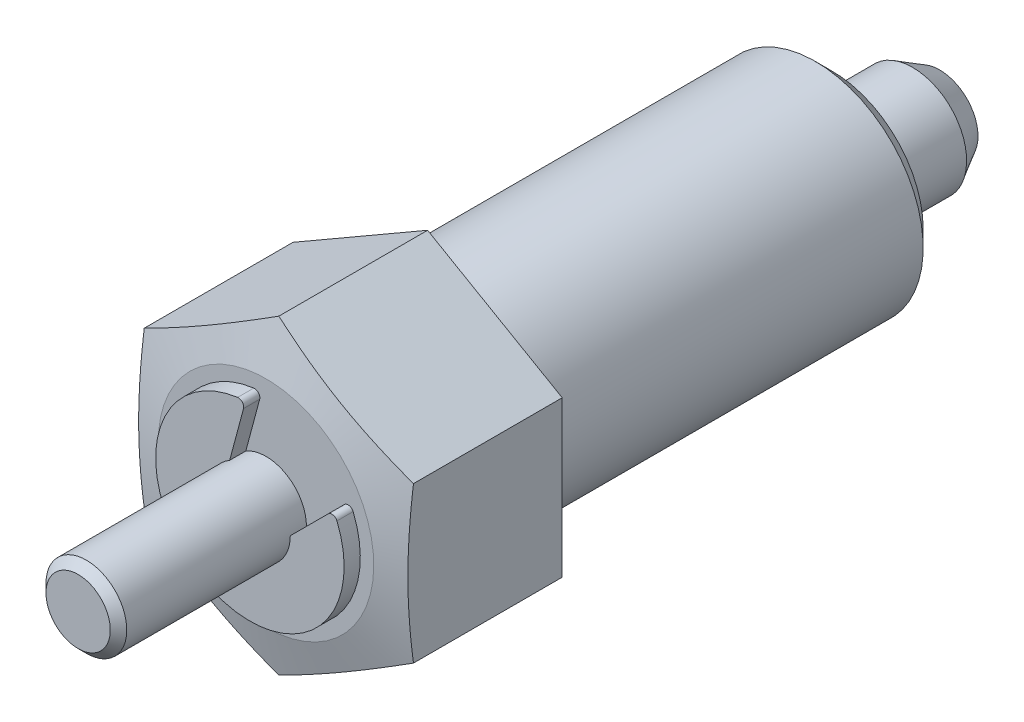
ISO-10303-21;
HEADER;
FILE_DESCRIPTION(('STEP AP214'),'2;1');
FILE_NAME('part.step','',(''),(''),'','','');
FILE_SCHEMA(('AUTOMOTIVE_DESIGN { 1 0 10303 214 1 1 1 1 }'));
ENDSEC;
DATA;
#1=APPLICATION_CONTEXT('core data for automotive mechanical design processes');
#2=APPLICATION_PROTOCOL_DEFINITION('international standard','automotive_design',2000,#1);
#3=PRODUCT_CONTEXT('',#1,'mechanical');
#4=PRODUCT('Part','Part','',(#3));
#5=PRODUCT_RELATED_PRODUCT_CATEGORY('part','',(#4));
#6=PRODUCT_DEFINITION_FORMATION('','',#4);
#7=PRODUCT_DEFINITION_CONTEXT('part definition',#1,'design');
#8=PRODUCT_DEFINITION('design','',#6,#7);
#9=PRODUCT_DEFINITION_SHAPE('','',#8);
#10=(LENGTH_UNIT() NAMED_UNIT(*) SI_UNIT(.MILLI.,.METRE.));
#11=(NAMED_UNIT(*) PLANE_ANGLE_UNIT() SI_UNIT($,.RADIAN.));
#12=(NAMED_UNIT(*) SI_UNIT($,.STERADIAN.) SOLID_ANGLE_UNIT());
#13=UNCERTAINTY_MEASURE_WITH_UNIT(LENGTH_MEASURE(1.E-05),#10,'distance_accuracy_value','');
#14=(GEOMETRIC_REPRESENTATION_CONTEXT(3) GLOBAL_UNCERTAINTY_ASSIGNED_CONTEXT((#13)) GLOBAL_UNIT_ASSIGNED_CONTEXT((#10,
#11,#12)) REPRESENTATION_CONTEXT('',''));
#15=CARTESIAN_POINT('',(0.,0.,0.));
#16=DIRECTION('',(0.,0.,1.));
#17=DIRECTION('',(1.,0.,0.));
#18=AXIS2_PLACEMENT_3D('',#15,#16,#17);
#19=CARTESIAN_POINT('',(-5.48810266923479,-1.50567266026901,6.));
#20=DIRECTION('',(0.,0.,1.));
#21=DIRECTION('',(0.866025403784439,-0.5,0.));
#22=AXIS2_PLACEMENT_3D('',#19,#20,#21);
#23=PLANE('',#22);
#24=CARTESIAN_POINT('',(-0.429841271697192,3.27188576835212,6.));
#25=DIRECTION('',(0.,0.,1.));
#26=DIRECTION('',(0.866025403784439,-0.5,0.));
#27=AXIS2_PLACEMENT_3D('',#24,#25,#26);
#28=CIRCLE('',#27,0.200000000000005);
#29=CARTESIAN_POINT('',(-0.236656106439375,3.22012195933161,6.));
#30=VERTEX_POINT('',#29);
#31=CARTESIAN_POINT('',(-0.455892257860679,3.47018187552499,6.));
#32=VERTEX_POINT('',#31);
#33=EDGE_CURVE('E108',#30,#32,#28,.T.);
#34=ORIENTED_EDGE('',*,*,#33,.F.);
#35=DIRECTION('',(0.258819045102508,0.965925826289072,0.));
#36=VECTOR('',#35,1.);
#37=CARTESIAN_POINT('',(-0.751667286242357,1.29807406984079,6.));
#38=LINE('',#37,#36);
#39=CARTESIAN_POINT('',(-0.751667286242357,1.29807406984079,6.));
#40=VERTEX_POINT('',#39);
#41=EDGE_CURVE('E31',#40,#30,#38,.T.);
#42=ORIENTED_EDGE('',*,*,#41,.F.);
#43=CARTESIAN_POINT('',(0.,0.,6.));
#44=DIRECTION('',(0.,0.,1.));
#45=DIRECTION('',(0.,-1.,0.));
#46=AXIS2_PLACEMENT_3D('',#43,#44,#45);
#47=CIRCLE('',#46,1.5);
#48=CARTESIAN_POINT('',(1.49999876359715,-0.00192593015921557,6.));
#49=VERTEX_POINT('',#48);
#50=EDGE_CURVE('E105',#40,#49,#47,.F.);
#51=ORIENTED_EDGE('',*,*,#50,.T.);
#52=DIRECTION('',(-0.70710678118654,-0.707106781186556,0.));
#53=VECTOR('',#52,1.);
#54=CARTESIAN_POINT('',(1.49999876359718,-0.00192593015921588,6.));
#55=LINE('',#54,#53);
#56=CARTESIAN_POINT('',(2.907035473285,1.40511077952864,6.));
#57=VERTEX_POINT('',#56);
#58=EDGE_CURVE('E39',#57,#49,#55,.T.);
#59=ORIENTED_EDGE('',*,*,#58,.F.);
#60=CARTESIAN_POINT('',(3.04845682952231,1.26368942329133,6.));
#61=DIRECTION('',(0.,0.,1.));
#62=DIRECTION('',(0.866025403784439,-0.5,0.));
#63=AXIS2_PLACEMENT_3D('',#60,#61,#62);
#64=CIRCLE('',#63,0.199999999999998);
#65=CARTESIAN_POINT('',(3.23321178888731,1.34027666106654,6.));
#66=VERTEX_POINT('',#65);
#67=EDGE_CURVE('E430',#66,#57,#64,.T.);
#68=ORIENTED_EDGE('',*,*,#67,.F.);
#69=CARTESIAN_POINT('',(0.,0.,6.));
#70=DIRECTION('',(0.,0.,1.));
#71=DIRECTION('',(0.866025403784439,-0.5,0.));
#72=AXIS2_PLACEMENT_3D('',#69,#70,#71);
#73=CIRCLE('',#72,3.49999999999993);
#74=EDGE_CURVE('E417',#32,#66,#73,.T.);
#75=ORIENTED_EDGE('',*,*,#74,.F.);
#76=EDGE_LOOP('',(#34,#42,#51,#59,#68,#75));
#77=FACE_BOUND('',#76,.T.);
#78=CARTESIAN_POINT('',(0.,0.,6.));
#79=DIRECTION('',(0.,0.,-1.));
#80=DIRECTION('',(0.5,0.866025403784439,0.));
#81=AXIS2_PLACEMENT_3D('',#78,#79,#80);
#82=CIRCLE('',#81,4.);
#83=CARTESIAN_POINT('',(1.99999999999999,3.46410161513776,6.));
#84=VERTEX_POINT('',#83);
#85=EDGE_CURVE('E9',#84,#84,#82,.T.);
#86=ORIENTED_EDGE('',*,*,#85,.F.);
#87=EDGE_LOOP('',(#86));
#88=FACE_BOUND('',#87,.T.);
#89=ADVANCED_FACE('F14',(#77,#88),#23,.T.);
#90=CARTESIAN_POINT('',(0.512187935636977,-1.95816393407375,-19.02));
#91=DIRECTION('',(0.,0.,-1.));
#92=DIRECTION('',(-0.86602540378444,0.5,0.));
#93=AXIS2_PLACEMENT_3D('',#90,#91,#92);
#94=PLANE('',#93);
#95=CARTESIAN_POINT('',(0.,0.,-19.02));
#96=DIRECTION('',(0.,0.,1.));
#97=DIRECTION('',(-0.5,-0.866025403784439,0.));
#98=AXIS2_PLACEMENT_3D('',#95,#96,#97);
#99=CIRCLE('',#98,1.42264973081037);
#100=CARTESIAN_POINT('',(-0.711324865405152,-1.23205080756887,-19.02));
#101=VERTEX_POINT('',#100);
#102=EDGE_CURVE('E18',#101,#101,#99,.T.);
#103=ORIENTED_EDGE('',*,*,#102,.F.);
#104=EDGE_LOOP('',(#103));
#105=FACE_BOUND('',#104,.T.);
#106=ADVANCED_FACE('F16',(#105),#94,.T.);
#107=CARTESIAN_POINT('',(0.,0.,-19.02));
#108=DIRECTION('',(0.,0.,1.));
#109=DIRECTION('',(-0.5,-0.866025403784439,0.));
#110=AXIS2_PLACEMENT_3D('',#107,#108,#109);
#111=CONICAL_SURFACE('',#110,1.42264973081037,0.5235987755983);
#112=CARTESIAN_POINT('',(0.,0.,-18.02));
#113=DIRECTION('',(0.,0.,1.));
#114=DIRECTION('',(0.866025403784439,-0.5,0.));
#115=AXIS2_PLACEMENT_3D('',#112,#113,#114);
#116=CIRCLE('',#115,2.);
#117=CARTESIAN_POINT('',(1.73205080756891,-1.,-18.02));
#118=VERTEX_POINT('',#117);
#119=EDGE_CURVE('E183',#118,#118,#116,.T.);
#120=ORIENTED_EDGE('',*,*,#119,.F.);
#121=EDGE_LOOP('',(#120));
#122=FACE_BOUND('',#121,.T.);
#123=ORIENTED_EDGE('',*,*,#102,.T.);
#124=EDGE_LOOP('',(#123));
#125=FACE_BOUND('',#124,.T.);
#126=ADVANCED_FACE('F287',(#122,#125),#111,.T.);
#127=CARTESIAN_POINT('',(0.,0.,-15.02));
#128=DIRECTION('',(0.,0.,1.));
#129=DIRECTION('',(-0.5,-0.866025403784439,0.));
#130=AXIS2_PLACEMENT_3D('',#127,#128,#129);
#131=CYLINDRICAL_SURFACE('',#130,2.);
#132=CARTESIAN_POINT('',(0.,0.,-15.02));
#133=DIRECTION('',(0.,0.,1.));
#134=DIRECTION('',(-0.5,-0.866025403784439,0.));
#135=AXIS2_PLACEMENT_3D('',#132,#133,#134);
#136=CIRCLE('',#135,2.);
#137=CARTESIAN_POINT('',(-0.999999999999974,-1.73205080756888,-15.02));
#138=VERTEX_POINT('',#137);
#139=EDGE_CURVE('E185',#138,#138,#136,.T.);
#140=ORIENTED_EDGE('',*,*,#139,.F.);
#141=EDGE_LOOP('',(#140));
#142=FACE_BOUND('',#141,.T.);
#143=ORIENTED_EDGE('',*,*,#119,.T.);
#144=EDGE_LOOP('',(#143));
#145=FACE_BOUND('',#144,.T.);
#146=ADVANCED_FACE('F284',(#142,#145),#131,.T.);
#147=CARTESIAN_POINT('',(-1.63751442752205,-0.449258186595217,12.98));
#148=DIRECTION('',(0.,0.,1.));
#149=DIRECTION('',(0.866025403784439,-0.5,0.));
#150=AXIS2_PLACEMENT_3D('',#147,#148,#149);
#151=PLANE('',#150);
#152=CARTESIAN_POINT('',(0.,0.,12.98));
#153=DIRECTION('',(0.,0.,-1.));
#154=DIRECTION('',(0.5,0.866025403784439,0.));
#155=AXIS2_PLACEMENT_3D('',#152,#153,#154);
#156=CIRCLE('',#155,1.1935);
#157=CARTESIAN_POINT('',(0.596749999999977,1.03360131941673,12.98));
#158=VERTEX_POINT('',#157);
#159=EDGE_CURVE('E513',#158,#158,#156,.T.);
#160=ORIENTED_EDGE('',*,*,#159,.F.);
#161=EDGE_LOOP('',(#160));
#162=FACE_BOUND('',#161,.T.);
#163=ADVANCED_FACE('F280',(#162),#151,.T.);
#164=CARTESIAN_POINT('',(1.21922497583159,-4.6612403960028,-15.02));
#165=DIRECTION('',(0.,0.,-1.));
#166=DIRECTION('',(-0.866025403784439,0.5,0.));
#167=AXIS2_PLACEMENT_3D('',#164,#165,#166);
#168=PLANE('',#167);
#169=ORIENTED_EDGE('',*,*,#139,.T.);
#170=EDGE_LOOP('',(#169));
#171=FACE_BOUND('',#170,.T.);
#172=CARTESIAN_POINT('',(0.,0.,-15.02));
#173=DIRECTION('',(0.,0.,1.));
#174=DIRECTION('',(-0.5,-0.866025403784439,0.));
#175=AXIS2_PLACEMENT_3D('',#172,#173,#174);
#176=CIRCLE('',#175,3.3865);
#177=CARTESIAN_POINT('',(-1.69324999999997,-2.932795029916,-15.02));
#178=VERTEX_POINT('',#177);
#179=EDGE_CURVE('E182',#178,#178,#176,.T.);
#180=ORIENTED_EDGE('',*,*,#179,.F.);
#181=EDGE_LOOP('',(#180));
#182=FACE_BOUND('',#181,.T.);
#183=ADVANCED_FACE('F276',(#171,#182),#168,.T.);
#184=CARTESIAN_POINT('',(0.,0.,12.98));
#185=DIRECTION('',(0.,0.,-1.));
#186=DIRECTION('',(0.5,0.866025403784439,0.));
#187=AXIS2_PLACEMENT_3D('',#184,#185,#186);
#188=CONICAL_SURFACE('',#187,1.1935,0.785398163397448);
#189=ORIENTED_EDGE('',*,*,#159,.T.);
#190=EDGE_LOOP('',(#189));
#191=FACE_BOUND('',#190,.T.);
#192=CARTESIAN_POINT('',(0.,0.,12.6735));
#193=DIRECTION('',(0.,0.,1.));
#194=DIRECTION('',(0.866025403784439,-0.5,0.));
#195=AXIS2_PLACEMENT_3D('',#192,#193,#194);
#196=CIRCLE('',#195,1.5);
#197=CARTESIAN_POINT('',(1.29903810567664,-0.75,12.6735));
#198=VERTEX_POINT('',#197);
#199=EDGE_CURVE('E179',#198,#198,#196,.F.);
#200=ORIENTED_EDGE('',*,*,#199,.F.);
#201=EDGE_LOOP('',(#200));
#202=FACE_BOUND('',#201,.T.);
#203=ADVANCED_FACE('F272',(#191,#202),#188,.T.);
#204=CARTESIAN_POINT('',(0.,0.,-15.02));
#205=DIRECTION('',(0.,0.,1.));
#206=DIRECTION('',(-0.5,-0.866025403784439,0.));
#207=AXIS2_PLACEMENT_3D('',#204,#205,#206);
#208=CONICAL_SURFACE('',#207,3.3865,0.785398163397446);
#209=CARTESIAN_POINT('',(0.,0.,-14.4065));
#210=DIRECTION('',(0.,0.,1.));
#211=DIRECTION('',(0.866025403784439,-0.5,0.));
#212=AXIS2_PLACEMENT_3D('',#209,#210,#211);
#213=CIRCLE('',#212,4.);
#214=CARTESIAN_POINT('',(3.46410161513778,-2.,-14.4065));
#215=VERTEX_POINT('',#214);
#216=EDGE_CURVE('E176',#215,#215,#213,.T.);
#217=ORIENTED_EDGE('',*,*,#216,.F.);
#218=EDGE_LOOP('',(#217));
#219=FACE_BOUND('',#218,.T.);
#220=ORIENTED_EDGE('',*,*,#179,.T.);
#221=EDGE_LOOP('',(#220));
#222=FACE_BOUND('',#221,.T.);
#223=ADVANCED_FACE('F269',(#219,#222),#208,.T.);
#224=CARTESIAN_POINT('',(0.,0.,12.6735));
#225=DIRECTION('',(0.,0.,1.));
#226=DIRECTION('',(-0.5,-0.866025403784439,0.));
#227=AXIS2_PLACEMENT_3D('',#224,#225,#226);
#228=CYLINDRICAL_SURFACE('',#227,1.5);
#229=ORIENTED_EDGE('',*,*,#50,.F.);
#230=DIRECTION('',(0.,0.,-1.));
#231=VECTOR('',#230,1.);
#232=CARTESIAN_POINT('',(-0.751667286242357,1.29807406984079,6.6));
#233=LINE('',#232,#231);
#234=CARTESIAN_POINT('',(-0.751667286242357,1.29807406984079,6.6));
#235=VERTEX_POINT('',#234);
#236=EDGE_CURVE('E117',#235,#40,#233,.T.);
#237=ORIENTED_EDGE('',*,*,#236,.F.);
#238=CARTESIAN_POINT('',(0.,0.,6.6));
#239=DIRECTION('',(0.,0.,-1.));
#240=DIRECTION('',(0.866025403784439,-0.5,0.));
#241=AXIS2_PLACEMENT_3D('',#238,#239,#240);
#242=CIRCLE('',#241,1.5);
#243=CARTESIAN_POINT('',(1.49999876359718,-0.00192593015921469,6.6));
#244=VERTEX_POINT('',#243);
#245=EDGE_CURVE('E425',#244,#235,#242,.T.);
#246=ORIENTED_EDGE('',*,*,#245,.F.);
#247=DIRECTION('',(0.,0.,-1.));
#248=VECTOR('',#247,1.);
#249=CARTESIAN_POINT('',(1.49999876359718,-0.00192593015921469,6.6));
#250=LINE('',#249,#248);
#251=EDGE_CURVE('E119',#244,#49,#250,.T.);
#252=ORIENTED_EDGE('',*,*,#251,.T.);
#253=EDGE_LOOP('',(#229,#237,#246,#252));
#254=FACE_BOUND('',#253,.T.);
#255=ORIENTED_EDGE('',*,*,#199,.T.);
#256=EDGE_LOOP('',(#255));
#257=FACE_BOUND('',#256,.T.);
#258=ADVANCED_FACE('F114',(#254,#257),#228,.T.);
#259=CARTESIAN_POINT('',(0.,0.,0.));
#260=DIRECTION('',(0.,0.,1.));
#261=DIRECTION('',(-0.5,-0.866025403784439,0.));
#262=AXIS2_PLACEMENT_3D('',#259,#260,#261);
#263=CYLINDRICAL_SURFACE('',#262,4.);
#264=CARTESIAN_POINT('',(0.,0.,0.));
#265=DIRECTION('',(0.,0.,1.));
#266=DIRECTION('',(-0.5,-0.866025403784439,0.));
#267=AXIS2_PLACEMENT_3D('',#264,#265,#266);
#268=CIRCLE('',#267,4.);
#269=CARTESIAN_POINT('',(-2.,-3.46410161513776,0.));
#270=VERTEX_POINT('',#269);
#271=EDGE_CURVE('E169',#270,#270,#268,.T.);
#272=ORIENTED_EDGE('',*,*,#271,.F.);
#273=EDGE_LOOP('',(#272));
#274=FACE_BOUND('',#273,.T.);
#275=ORIENTED_EDGE('',*,*,#216,.T.);
#276=EDGE_LOOP('',(#275));
#277=FACE_BOUND('',#276,.T.);
#278=ADVANCED_FACE('F262',(#274,#277),#263,.T.);
#279=CARTESIAN_POINT('',(2.5,-7.21687836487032,0.));
#280=DIRECTION('',(0.,0.,-1.));
#281=DIRECTION('',(-0.866025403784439,0.5,0.));
#282=AXIS2_PLACEMENT_3D('',#279,#280,#281);
#283=PLANE('',#282);
#284=ORIENTED_EDGE('',*,*,#271,.T.);
#285=EDGE_LOOP('',(#284));
#286=FACE_BOUND('',#285,.T.);
#287=DIRECTION('',(0.,-1.,0.));
#288=VECTOR('',#287,1.);
#289=CARTESIAN_POINT('',(-5.,0.,0.));
#290=LINE('',#289,#288);
#291=CARTESIAN_POINT('',(-5.,2.88675134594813,0.));
#292=VERTEX_POINT('',#291);
#293=CARTESIAN_POINT('',(-5.,-2.88675134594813,0.));
#294=VERTEX_POINT('',#293);
#295=EDGE_CURVE('E166',#292,#294,#290,.T.);
#296=ORIENTED_EDGE('',*,*,#295,.F.);
#297=DIRECTION('',(-0.866025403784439,-0.5,0.));
#298=VECTOR('',#297,1.);
#299=CARTESIAN_POINT('',(-2.5,4.3301270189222,0.));
#300=LINE('',#299,#298);
#301=CARTESIAN_POINT('',(0.,5.77350269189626,0.));
#302=VERTEX_POINT('',#301);
#303=EDGE_CURVE('E142',#302,#292,#300,.T.);
#304=ORIENTED_EDGE('',*,*,#303,.F.);
#305=DIRECTION('',(-0.866025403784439,0.5,0.));
#306=VECTOR('',#305,1.);
#307=CARTESIAN_POINT('',(2.5,4.3301270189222,0.));
#308=LINE('',#307,#306);
#309=CARTESIAN_POINT('',(5.,2.88675134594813,0.));
#310=VERTEX_POINT('',#309);
#311=EDGE_CURVE('E149',#310,#302,#308,.T.);
#312=ORIENTED_EDGE('',*,*,#311,.F.);
#313=DIRECTION('',(0.,1.,0.));
#314=VECTOR('',#313,1.);
#315=CARTESIAN_POINT('',(5.,0.,0.));
#316=LINE('',#315,#314);
#317=CARTESIAN_POINT('',(5.,-2.88675134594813,0.));
#318=VERTEX_POINT('',#317);
#319=EDGE_CURVE('E153',#318,#310,#316,.T.);
#320=ORIENTED_EDGE('',*,*,#319,.F.);
#321=DIRECTION('',(0.866025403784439,0.5,0.));
#322=VECTOR('',#321,1.);
#323=CARTESIAN_POINT('',(2.5,-4.3301270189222,0.));
#324=LINE('',#323,#322);
#325=CARTESIAN_POINT('',(0.,-5.77350269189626,0.));
#326=VERTEX_POINT('',#325);
#327=EDGE_CURVE('E157',#326,#318,#324,.T.);
#328=ORIENTED_EDGE('',*,*,#327,.F.);
#329=DIRECTION('',(0.866025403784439,-0.5,0.));
#330=VECTOR('',#329,1.);
#331=CARTESIAN_POINT('',(-2.5,-4.3301270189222,0.));
#332=LINE('',#331,#330);
#333=EDGE_CURVE('E161',#294,#326,#332,.T.);
#334=ORIENTED_EDGE('',*,*,#333,.F.);
#335=EDGE_LOOP('',(#296,#304,#312,#320,#328,#334));
#336=FACE_BOUND('',#335,.T.);
#337=ADVANCED_FACE('F258',(#286,#336),#283,.T.);
#338=CARTESIAN_POINT('',(-5.,-2.88675134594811,5.7664438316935));
#339=DIRECTION('',(-1.,0.,0.));
#340=DIRECTION('',(0.,1.,0.));
#341=AXIS2_PLACEMENT_3D('',#338,#339,#340);
#342=PLANE('',#341);
#343=CARTESIAN_POINT('',(-5.,2.88675134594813,5.52479138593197));
#344=CARTESIAN_POINT('',(-5.,2.64699225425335,5.55692517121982));
#345=CARTESIAN_POINT('',(-5.,2.40679847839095,5.58609724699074));
#346=CARTESIAN_POINT('',(-5.,1.92556274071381,5.63734972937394));
#347=CARTESIAN_POINT('',(-5.,1.68452047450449,5.65942725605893));
#348=CARTESIAN_POINT('',(-5.,1.20304905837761,5.69520187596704));
#349=CARTESIAN_POINT('',(-5.,0.962623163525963,5.70894162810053));
#350=CARTESIAN_POINT('',(-5.,0.481464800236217,5.72736521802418));
#351=CARTESIAN_POINT('',(-5.,0.240732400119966,5.73205080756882));
#352=CARTESIAN_POINT('',(-5.,-0.240732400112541,5.73205080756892));
#353=CARTESIAN_POINT('',(-5.,-0.481464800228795,5.72736521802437));
#354=CARTESIAN_POINT('',(-5.,-0.96262316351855,5.7089416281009));
#355=CARTESIAN_POINT('',(-5.,-1.2030490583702,5.6952018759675));
#356=CARTESIAN_POINT('',(-5.,-1.68452047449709,5.65942725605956));
#357=CARTESIAN_POINT('',(-5.,-1.92556274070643,5.63734972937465));
#358=CARTESIAN_POINT('',(-5.,-2.40679847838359,5.5860972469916));
#359=CARTESIAN_POINT('',(-5.,-2.64699225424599,5.55692517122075));
#360=CARTESIAN_POINT('',(-5.,-2.88675134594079,5.52479138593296));
#361=B_SPLINE_CURVE_WITH_KNOTS('',3,(#343,#344,#345,#346,#347,#348,#349,#350,#351,#352,#353,
#354,#355,#356,#357,#358,#359,#360),.UNSPECIFIED.,.F.,.F.,(4,2,2,2,2,2,2,2,4),(0.,
0.725746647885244,1.45178753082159,2.17408171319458,2.89623613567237,3.61839055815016,
4.34068474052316,5.0667256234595,5.79247227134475),.UNSPECIFIED.);
#362=CARTESIAN_POINT('',(-5.,2.88675134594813,5.52479138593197));
#363=VERTEX_POINT('',#362);
#364=CARTESIAN_POINT('',(-4.99999999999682,-2.88675134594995,5.52479138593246));
#365=VERTEX_POINT('',#364);
#366=EDGE_CURVE('E145',#363,#365,#361,.T.);
#367=ORIENTED_EDGE('',*,*,#366,.F.);
#368=DIRECTION('',(0.,0.,-1.));
#369=VECTOR('',#368,1.);
#370=CARTESIAN_POINT('',(-5.,2.88675134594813,5.91154273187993));
#371=LINE('',#370,#369);
#372=EDGE_CURVE('E138',#292,#363,#371,.F.);
#373=ORIENTED_EDGE('',*,*,#372,.F.);
#374=ORIENTED_EDGE('',*,*,#295,.T.);
#375=DIRECTION('',(0.,0.,-1.));
#376=VECTOR('',#375,1.);
#377=CARTESIAN_POINT('',(-5.,-2.88675134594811,5.91154273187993));
#378=LINE('',#377,#376);
#379=EDGE_CURVE('E158',#365,#294,#378,.T.);
#380=ORIENTED_EDGE('',*,*,#379,.F.);
#381=EDGE_LOOP('',(#367,#373,#374,#380));
#382=FACE_BOUND('',#381,.T.);
#383=ADVANCED_FACE('F253',(#382),#342,.T.);
#384=CARTESIAN_POINT('',(0.,-5.77350269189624,5.76644383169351));
#385=DIRECTION('',(-0.5,-0.866025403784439,0.));
#386=DIRECTION('',(-0.866025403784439,0.5,0.));
#387=AXIS2_PLACEMENT_3D('',#384,#385,#386);
#388=PLANE('',#387);
#389=CARTESIAN_POINT('',(-4.99999999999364,-2.88675134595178,5.52479138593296));
#390=CARTESIAN_POINT('',(-4.79236253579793,-3.00663089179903,5.55692517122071));
#391=CARTESIAN_POINT('',(-4.58434862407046,-3.12672777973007,5.58609724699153));
#392=CARTESIAN_POINT('',(-4.16758625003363,-3.36734564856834,5.63734972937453));
#393=CARTESIAN_POINT('',(-3.95883752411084,-3.48786678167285,5.65942725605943));
#394=CARTESIAN_POINT('',(-3.54187104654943,-3.72860248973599,5.69520187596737));
#395=CARTESIAN_POINT('',(-3.33365611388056,-3.84881543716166,5.70894162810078));
#396=CARTESIAN_POINT('',(-2.91696074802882,-4.08939461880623,5.72736521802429));
#397=CARTESIAN_POINT('',(-2.70848037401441,-4.2097608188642,5.73205080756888));
#398=CARTESIAN_POINT('',(-2.29151962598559,-4.45049321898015,5.73205080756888));
#399=CARTESIAN_POINT('',(-2.08303925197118,-4.57085941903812,5.72736521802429));
#400=CARTESIAN_POINT('',(-1.66634388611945,-4.81143860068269,5.70894162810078));
#401=CARTESIAN_POINT('',(-1.45812895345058,-4.93165154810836,5.69520187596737));
#402=CARTESIAN_POINT('',(-1.04116247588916,-5.1723872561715,5.65942725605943));
#403=CARTESIAN_POINT('',(-0.832413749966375,-5.29290838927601,5.63734972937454));
#404=CARTESIAN_POINT('',(-0.415651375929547,-5.53352625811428,5.58609724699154));
#405=CARTESIAN_POINT('',(-0.207637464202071,-5.65362314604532,5.55692517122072));
#406=CARTESIAN_POINT('',(-6.3651341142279E-12,-5.77350269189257,5.52479138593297));
#407=B_SPLINE_CURVE_WITH_KNOTS('',3,(#389,#390,#391,#392,#393,#394,#395,#396,#397,#398,#399,
#400,#401,#402,#403,#404,#405,#406),.UNSPECIFIED.,.F.,.F.,(4,2,2,2,2,2,2,2,4),(0.,
0.725746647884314,1.45178753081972,2.1740817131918,2.89623613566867,3.61839055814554,
4.34068474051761,5.06672562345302,5.79247227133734),.UNSPECIFIED.);
#408=CARTESIAN_POINT('',(3.16933979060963E-12,-5.77350269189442,5.52479138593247));
#409=VERTEX_POINT('',#408);
#410=EDGE_CURVE('E237',#365,#409,#407,.T.);
#411=ORIENTED_EDGE('',*,*,#410,.F.);
#412=ORIENTED_EDGE('',*,*,#379,.T.);
#413=ORIENTED_EDGE('',*,*,#333,.T.);
#414=DIRECTION('',(0.,0.,-1.));
#415=VECTOR('',#414,1.);
#416=CARTESIAN_POINT('',(0.,-5.77350269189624,5.91154273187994));
#417=LINE('',#416,#415);
#418=EDGE_CURVE('E154',#409,#326,#417,.T.);
#419=ORIENTED_EDGE('',*,*,#418,.F.);
#420=EDGE_LOOP('',(#411,#412,#413,#419));
#421=FACE_BOUND('',#420,.T.);
#422=ADVANCED_FACE('F250',(#421),#388,.T.);
#423=CARTESIAN_POINT('',(5.,-2.88675134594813,5.76644383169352));
#424=DIRECTION('',(0.5,-0.866025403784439,0.));
#425=DIRECTION('',(-0.866025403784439,-0.5,0.));
#426=AXIS2_PLACEMENT_3D('',#423,#424,#425);
#427=PLANE('',#426);
#428=CARTESIAN_POINT('',(6.35255736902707E-12,-5.77350269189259,5.52479138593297));
#429=CARTESIAN_POINT('',(0.207637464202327,-5.65362314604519,5.55692517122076));
#430=CARTESIAN_POINT('',(0.415651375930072,-5.53352625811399,5.58609724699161));
#431=CARTESIAN_POINT('',(0.83241374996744,-5.29290838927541,5.63734972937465));
#432=CARTESIAN_POINT('',(1.04116247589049,-5.17238725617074,5.65942725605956));
#433=CARTESIAN_POINT('',(1.45812895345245,-4.9316515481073,5.69520187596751));
#434=CARTESIAN_POINT('',(1.66634388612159,-4.81143860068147,5.70894162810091));
#435=CARTESIAN_POINT('',(2.08303925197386,-4.57085941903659,5.72736521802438));
#436=CARTESIAN_POINT('',(2.29151962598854,-4.45049321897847,5.73205080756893));
#437=CARTESIAN_POINT('',(2.70848037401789,-4.20976081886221,5.73205080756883));
#438=CARTESIAN_POINT('',(2.91696074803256,-4.08939461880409,5.72736521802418));
#439=CARTESIAN_POINT('',(3.33365611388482,-3.84881543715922,5.70894162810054));
#440=CARTESIAN_POINT('',(3.54187104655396,-3.72860248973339,5.69520187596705));
#441=CARTESIAN_POINT('',(3.9588375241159,-3.48786678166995,5.65942725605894));
#442=CARTESIAN_POINT('',(4.16758625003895,-3.36734564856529,5.63734972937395));
#443=CARTESIAN_POINT('',(4.5843486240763,-3.12672777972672,5.58609724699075));
#444=CARTESIAN_POINT('',(4.79236253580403,-3.00663089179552,5.55692517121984));
#445=CARTESIAN_POINT('',(5.,-2.88675134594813,5.52479138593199));
#446=B_SPLINE_CURVE_WITH_KNOTS('',3,(#428,#429,#430,#431,#432,#433,#434,#435,#436,#437,#438,
#439,#440,#441,#442,#443,#444,#445),.UNSPECIFIED.,.F.,.F.,(4,2,2,2,2,2,2,2,4),(0.,
0.725746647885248,1.45178753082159,2.1740817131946,2.89623613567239,3.61839055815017,
4.34068474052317,5.06672562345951,5.79247227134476),.UNSPECIFIED.);
#447=CARTESIAN_POINT('',(5.,-2.88675134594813,5.52479138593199));
#448=VERTEX_POINT('',#447);
#449=EDGE_CURVE('E230',#409,#448,#446,.T.);
#450=ORIENTED_EDGE('',*,*,#449,.F.);
#451=ORIENTED_EDGE('',*,*,#418,.T.);
#452=ORIENTED_EDGE('',*,*,#327,.T.);
#453=DIRECTION('',(0.,0.,-1.));
#454=VECTOR('',#453,1.);
#455=CARTESIAN_POINT('',(5.,-2.88675134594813,5.91154273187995));
#456=LINE('',#455,#454);
#457=EDGE_CURVE('E150',#448,#318,#456,.T.);
#458=ORIENTED_EDGE('',*,*,#457,.F.);
#459=EDGE_LOOP('',(#450,#451,#452,#458));
#460=FACE_BOUND('',#459,.T.);
#461=ADVANCED_FACE('F219',(#460),#427,.T.);
#462=CARTESIAN_POINT('',(5.,2.88675134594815,5.76644383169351));
#463=DIRECTION('',(1.,0.,0.));
#464=DIRECTION('',(0.,-1.,0.));
#465=AXIS2_PLACEMENT_3D('',#462,#463,#464);
#466=PLANE('',#465);
#467=CARTESIAN_POINT('',(5.,-2.88675134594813,5.52479138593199));
#468=CARTESIAN_POINT('',(5.,-2.64699225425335,5.55692517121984));
#469=CARTESIAN_POINT('',(5.,-2.40679847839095,5.58609724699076));
#470=CARTESIAN_POINT('',(5.,-1.92556274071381,5.63734972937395));
#471=CARTESIAN_POINT('',(5.,-1.68452047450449,5.65942725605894));
#472=CARTESIAN_POINT('',(5.,-1.20304905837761,5.69520187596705));
#473=CARTESIAN_POINT('',(5.,-0.962623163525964,5.70894162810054));
#474=CARTESIAN_POINT('',(5.,-0.481464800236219,5.72736521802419));
#475=CARTESIAN_POINT('',(5.,-0.240732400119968,5.73205080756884));
#476=CARTESIAN_POINT('',(5.,0.240732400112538,5.73205080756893));
#477=CARTESIAN_POINT('',(5.,0.481464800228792,5.72736521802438));
#478=CARTESIAN_POINT('',(5.,0.962623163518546,5.70894162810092));
#479=CARTESIAN_POINT('',(5.,1.2030490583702,5.69520187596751));
#480=CARTESIAN_POINT('',(5.,1.68452047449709,5.65942725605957));
#481=CARTESIAN_POINT('',(5.,1.92556274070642,5.63734972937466));
#482=CARTESIAN_POINT('',(5.,2.40679847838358,5.58609724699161));
#483=CARTESIAN_POINT('',(5.,2.64699225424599,5.55692517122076));
#484=CARTESIAN_POINT('',(5.,2.88675134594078,5.52479138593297));
#485=B_SPLINE_CURVE_WITH_KNOTS('',3,(#467,#468,#469,#470,#471,#472,#473,#474,#475,#476,#477,
#478,#479,#480,#481,#482,#483,#484),.UNSPECIFIED.,.F.,.F.,(4,2,2,2,2,2,2,2,4),(0.,
0.725746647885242,1.45178753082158,2.17408171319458,2.89623613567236,3.61839055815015,
4.34068474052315,5.0667256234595,5.79247227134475),.UNSPECIFIED.);
#486=CARTESIAN_POINT('',(4.99999999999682,2.88675134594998,5.52479138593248));
#487=VERTEX_POINT('',#486);
#488=EDGE_CURVE('E223',#448,#487,#485,.T.);
#489=ORIENTED_EDGE('',*,*,#488,.F.);
#490=ORIENTED_EDGE('',*,*,#457,.T.);
#491=ORIENTED_EDGE('',*,*,#319,.T.);
#492=DIRECTION('',(0.,0.,-1.));
#493=VECTOR('',#492,1.);
#494=CARTESIAN_POINT('',(5.,2.88675134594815,5.91154273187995));
#495=LINE('',#494,#493);
#496=EDGE_CURVE('E146',#487,#310,#495,.T.);
#497=ORIENTED_EDGE('',*,*,#496,.F.);
#498=EDGE_LOOP('',(#489,#490,#491,#497));
#499=FACE_BOUND('',#498,.T.);
#500=ADVANCED_FACE('F214',(#499),#466,.T.);
#501=CARTESIAN_POINT('',(0.,5.77350269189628,5.7664438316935));
#502=DIRECTION('',(0.5,0.866025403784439,0.));
#503=DIRECTION('',(0.866025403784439,-0.5,0.));
#504=AXIS2_PLACEMENT_3D('',#501,#502,#503);
#505=PLANE('',#504);
#506=CARTESIAN_POINT('',(4.99999999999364,2.88675134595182,5.52479138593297));
#507=CARTESIAN_POINT('',(4.79236253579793,3.00663089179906,5.55692517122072));
#508=CARTESIAN_POINT('',(4.58434862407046,3.12672777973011,5.58609724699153));
#509=CARTESIAN_POINT('',(4.16758625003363,3.36734564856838,5.63734972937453));
#510=CARTESIAN_POINT('',(3.95883752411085,3.48786678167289,5.65942725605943));
#511=CARTESIAN_POINT('',(3.54187104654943,3.72860248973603,5.69520187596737));
#512=CARTESIAN_POINT('',(3.33365611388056,3.8488154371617,5.70894162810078));
#513=CARTESIAN_POINT('',(2.91696074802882,4.08939461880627,5.72736521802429));
#514=CARTESIAN_POINT('',(2.70848037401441,4.20976081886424,5.73205080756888));
#515=CARTESIAN_POINT('',(2.29151962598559,4.45049321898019,5.73205080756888));
#516=CARTESIAN_POINT('',(2.08303925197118,4.57085941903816,5.72736521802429));
#517=CARTESIAN_POINT('',(1.66634388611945,4.81143860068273,5.70894162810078));
#518=CARTESIAN_POINT('',(1.45812895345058,4.9316515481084,5.69520187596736));
#519=CARTESIAN_POINT('',(1.04116247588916,5.17238725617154,5.65942725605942));
#520=CARTESIAN_POINT('',(0.832413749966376,5.29290838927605,5.63734972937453));
#521=CARTESIAN_POINT('',(0.415651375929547,5.53352625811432,5.58609724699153));
#522=CARTESIAN_POINT('',(0.20763746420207,5.65362314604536,5.55692517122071));
#523=CARTESIAN_POINT('',(6.36036362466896E-12,5.7735026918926,5.52479138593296));
#524=B_SPLINE_CURVE_WITH_KNOTS('',3,(#506,#507,#508,#509,#510,#511,#512,#513,#514,#515,#516,
#517,#518,#519,#520,#521,#522,#523),.UNSPECIFIED.,.F.,.F.,(4,2,2,2,2,2,2,2,4),(0.,
0.725746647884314,1.45178753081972,2.1740817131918,2.89623613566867,3.61839055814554,
4.34068474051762,5.06672562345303,5.79247227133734),.UNSPECIFIED.);
#525=CARTESIAN_POINT('',(-3.1936259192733E-12,5.77350269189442,5.52479138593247));
#526=VERTEX_POINT('',#525);
#527=EDGE_CURVE('E195',#487,#526,#524,.T.);
#528=ORIENTED_EDGE('',*,*,#527,.F.);
#529=ORIENTED_EDGE('',*,*,#496,.T.);
#530=ORIENTED_EDGE('',*,*,#311,.T.);
#531=DIRECTION('',(0.,0.,-1.));
#532=VECTOR('',#531,1.);
#533=CARTESIAN_POINT('',(0.,5.77350269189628,5.91154273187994));
#534=LINE('',#533,#532);
#535=EDGE_CURVE('E141',#526,#302,#534,.T.);
#536=ORIENTED_EDGE('',*,*,#535,.F.);
#537=EDGE_LOOP('',(#528,#529,#530,#536));
#538=FACE_BOUND('',#537,.T.);
#539=ADVANCED_FACE('F209',(#538),#505,.T.);
#540=CARTESIAN_POINT('',(-5.,2.88675134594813,5.7664438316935));
#541=DIRECTION('',(-0.5,0.866025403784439,0.));
#542=DIRECTION('',(0.866025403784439,0.5,0.));
#543=AXIS2_PLACEMENT_3D('',#540,#541,#542);
#544=PLANE('',#543);
#545=CARTESIAN_POINT('',(-6.3729403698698E-12,5.77350269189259,5.52479138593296));
#546=CARTESIAN_POINT('',(-0.207637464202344,5.65362314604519,5.55692517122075));
#547=CARTESIAN_POINT('',(-0.415651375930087,5.53352625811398,5.58609724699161));
#548=CARTESIAN_POINT('',(-0.832413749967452,5.2929083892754,5.63734972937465));
#549=CARTESIAN_POINT('',(-1.04116247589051,5.17238725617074,5.65942725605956));
#550=CARTESIAN_POINT('',(-1.45812895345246,4.93165154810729,5.69520187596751));
#551=CARTESIAN_POINT('',(-1.6663438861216,4.81143860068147,5.70894162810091));
#552=CARTESIAN_POINT('',(-2.08303925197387,4.57085941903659,5.72736521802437));
#553=CARTESIAN_POINT('',(-2.29151962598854,4.45049321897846,5.73205080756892));
#554=CARTESIAN_POINT('',(-2.70848037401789,4.20976081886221,5.73205080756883));
#555=CARTESIAN_POINT('',(-2.91696074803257,4.08939461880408,5.72736521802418));
#556=CARTESIAN_POINT('',(-3.33365611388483,3.84881543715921,5.70894162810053));
#557=CARTESIAN_POINT('',(-3.54187104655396,3.72860248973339,5.69520187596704));
#558=CARTESIAN_POINT('',(-3.9588375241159,3.48786678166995,5.65942725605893));
#559=CARTESIAN_POINT('',(-4.16758625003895,3.36734564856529,5.63734972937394));
#560=CARTESIAN_POINT('',(-4.5843486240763,3.12672777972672,5.58609724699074));
#561=CARTESIAN_POINT('',(-4.79236253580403,3.00663089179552,5.55692517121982));
#562=CARTESIAN_POINT('',(-5.,2.88675134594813,5.52479138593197));
#563=B_SPLINE_CURVE_WITH_KNOTS('',3,(#545,#546,#547,#548,#549,#550,#551,#552,#553,#554,#555,
#556,#557,#558,#559,#560,#561,#562),.UNSPECIFIED.,.F.,.F.,(4,2,2,2,2,2,2,2,4),(0.,
0.725746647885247,1.45178753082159,2.17408171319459,2.89623613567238,3.61839055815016,
4.34068474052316,5.0667256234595,5.79247227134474),.UNSPECIFIED.);
#564=EDGE_CURVE('E23',#526,#363,#563,.T.);
#565=ORIENTED_EDGE('',*,*,#564,.F.);
#566=ORIENTED_EDGE('',*,*,#535,.T.);
#567=ORIENTED_EDGE('',*,*,#303,.T.);
#568=ORIENTED_EDGE('',*,*,#372,.T.);
#569=EDGE_LOOP('',(#565,#566,#567,#568));
#570=FACE_BOUND('',#569,.T.);
#571=ADVANCED_FACE('F206',(#570),#544,.T.);
#572=CARTESIAN_POINT('',(0.,0.,6.));
#573=DIRECTION('',(0.,0.,-1.));
#574=DIRECTION('',(0.5,0.866025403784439,0.));
#575=AXIS2_PLACEMENT_3D('',#572,#573,#574);
#576=CONICAL_SURFACE('',#575,4.,1.30899693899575);
#577=ORIENTED_EDGE('',*,*,#449,.T.);
#578=ORIENTED_EDGE('',*,*,#488,.T.);
#579=ORIENTED_EDGE('',*,*,#527,.T.);
#580=ORIENTED_EDGE('',*,*,#564,.T.);
#581=ORIENTED_EDGE('',*,*,#366,.T.);
#582=ORIENTED_EDGE('',*,*,#410,.T.);
#583=EDGE_LOOP('',(#577,#578,#579,#580,#581,#582));
#584=FACE_BOUND('',#583,.T.);
#585=ORIENTED_EDGE('',*,*,#85,.T.);
#586=EDGE_LOOP('',(#585));
#587=FACE_BOUND('',#586,.T.);
#588=ADVANCED_FACE('F202',(#584,#587),#576,.T.);
#589=CARTESIAN_POINT('',(-0.429841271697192,3.27188576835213,6.6));
#590=DIRECTION('',(0.,0.,-1.));
#591=DIRECTION('',(-0.866025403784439,0.5,0.));
#592=AXIS2_PLACEMENT_3D('',#589,#590,#591);
#593=CYLINDRICAL_SURFACE('',#592,0.200000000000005);
#594=ORIENTED_EDGE('',*,*,#33,.T.);
#595=DIRECTION('',(0.,0.,-1.));
#596=VECTOR('',#595,1.);
#597=CARTESIAN_POINT('',(-0.455892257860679,3.47018187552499,6.6));
#598=LINE('',#597,#596);
#599=CARTESIAN_POINT('',(-0.455892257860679,3.47018187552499,6.6));
#600=VERTEX_POINT('',#599);
#601=EDGE_CURVE('E135',#600,#32,#598,.T.);
#602=ORIENTED_EDGE('',*,*,#601,.F.);
#603=CARTESIAN_POINT('',(-0.429841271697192,3.27188576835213,6.6));
#604=DIRECTION('',(0.,0.,1.));
#605=DIRECTION('',(0.866025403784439,-0.5,0.));
#606=AXIS2_PLACEMENT_3D('',#603,#604,#605);
#607=CIRCLE('',#606,0.200000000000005);
#608=CARTESIAN_POINT('',(-0.236656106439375,3.22012195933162,6.6));
#609=VERTEX_POINT('',#608);
#610=EDGE_CURVE('E110',#609,#600,#607,.T.);
#611=ORIENTED_EDGE('',*,*,#610,.F.);
#612=DIRECTION('',(0.,0.,-1.));
#613=VECTOR('',#612,1.);
#614=CARTESIAN_POINT('',(-0.236656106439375,3.22012195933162,6.6));
#615=LINE('',#614,#613);
#616=EDGE_CURVE('E124',#609,#30,#615,.T.);
#617=ORIENTED_EDGE('',*,*,#616,.T.);
#618=EDGE_LOOP('',(#594,#602,#611,#617));
#619=FACE_BOUND('',#618,.T.);
#620=ADVANCED_FACE('F296',(#619),#593,.T.);
#621=CARTESIAN_POINT('',(0.,0.,6.6));
#622=DIRECTION('',(0.,0.,-1.));
#623=DIRECTION('',(-0.866025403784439,0.5,0.));
#624=AXIS2_PLACEMENT_3D('',#621,#622,#623);
#625=CYLINDRICAL_SURFACE('',#624,3.49999999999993);
#626=ORIENTED_EDGE('',*,*,#74,.T.);
#627=DIRECTION('',(0.,0.,-1.));
#628=VECTOR('',#627,1.);
#629=CARTESIAN_POINT('',(3.23321178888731,1.34027666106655,6.6));
#630=LINE('',#629,#628);
#631=CARTESIAN_POINT('',(3.23321178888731,1.34027666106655,6.6));
#632=VERTEX_POINT('',#631);
#633=EDGE_CURVE('E132',#632,#66,#630,.T.);
#634=ORIENTED_EDGE('',*,*,#633,.F.);
#635=CARTESIAN_POINT('',(0.,0.,6.6));
#636=DIRECTION('',(0.,0.,1.));
#637=DIRECTION('',(0.866025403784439,-0.5,0.));
#638=AXIS2_PLACEMENT_3D('',#635,#636,#637);
#639=CIRCLE('',#638,3.49999999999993);
#640=EDGE_CURVE('E413',#600,#632,#639,.T.);
#641=ORIENTED_EDGE('',*,*,#640,.F.);
#642=ORIENTED_EDGE('',*,*,#601,.T.);
#643=EDGE_LOOP('',(#626,#634,#641,#642));
#644=FACE_BOUND('',#643,.T.);
#645=ADVANCED_FACE('F307',(#644),#625,.T.);
#646=CARTESIAN_POINT('',(3.04845682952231,1.26368942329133,6.6));
#647=DIRECTION('',(0.,0.,-1.));
#648=DIRECTION('',(-0.866025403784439,0.5,0.));
#649=AXIS2_PLACEMENT_3D('',#646,#647,#648);
#650=CYLINDRICAL_SURFACE('',#649,0.199999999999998);
#651=ORIENTED_EDGE('',*,*,#67,.T.);
#652=DIRECTION('',(0.,0.,-1.));
#653=VECTOR('',#652,1.);
#654=CARTESIAN_POINT('',(2.907035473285,1.40511077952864,6.6));
#655=LINE('',#654,#653);
#656=CARTESIAN_POINT('',(2.907035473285,1.40511077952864,6.6));
#657=VERTEX_POINT('',#656);
#658=EDGE_CURVE('E126',#657,#57,#655,.T.);
#659=ORIENTED_EDGE('',*,*,#658,.F.);
#660=CARTESIAN_POINT('',(3.04845682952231,1.26368942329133,6.6));
#661=DIRECTION('',(0.,0.,1.));
#662=DIRECTION('',(0.866025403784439,-0.5,0.));
#663=AXIS2_PLACEMENT_3D('',#660,#661,#662);
#664=CIRCLE('',#663,0.199999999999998);
#665=EDGE_CURVE('E419',#632,#657,#664,.T.);
#666=ORIENTED_EDGE('',*,*,#665,.F.);
#667=ORIENTED_EDGE('',*,*,#633,.T.);
#668=EDGE_LOOP('',(#651,#659,#666,#667));
#669=FACE_BOUND('',#668,.T.);
#670=ADVANCED_FACE('F367',(#669),#650,.T.);
#671=CARTESIAN_POINT('',(1.49999876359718,-0.00192593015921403,6.6));
#672=DIRECTION('',(0.707106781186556,-0.70710678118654,0.));
#673=DIRECTION('',(0.70710678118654,0.707106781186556,0.));
#674=AXIS2_PLACEMENT_3D('',#671,#672,#673);
#675=PLANE('',#674);
#676=ORIENTED_EDGE('',*,*,#58,.T.);
#677=ORIENTED_EDGE('',*,*,#251,.F.);
#678=DIRECTION('',(-0.70710678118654,-0.707106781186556,0.));
#679=VECTOR('',#678,1.);
#680=CARTESIAN_POINT('',(1.49999876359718,-0.00192593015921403,6.6));
#681=LINE('',#680,#679);
#682=EDGE_CURVE('E421',#657,#244,#681,.T.);
#683=ORIENTED_EDGE('',*,*,#682,.F.);
#684=ORIENTED_EDGE('',*,*,#658,.T.);
#685=EDGE_LOOP('',(#676,#677,#683,#684));
#686=FACE_BOUND('',#685,.T.);
#687=ADVANCED_FACE('F378',(#686),#675,.F.);
#688=CARTESIAN_POINT('',(-0.751667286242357,1.29807406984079,6.6));
#689=DIRECTION('',(-0.965925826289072,0.258819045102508,0.));
#690=DIRECTION('',(-0.258819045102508,-0.965925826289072,0.));
#691=AXIS2_PLACEMENT_3D('',#688,#689,#690);
#692=PLANE('',#691);
#693=ORIENTED_EDGE('',*,*,#41,.T.);
#694=ORIENTED_EDGE('',*,*,#616,.F.);
#695=DIRECTION('',(0.258819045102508,0.965925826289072,0.));
#696=VECTOR('',#695,1.);
#697=CARTESIAN_POINT('',(-0.751667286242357,1.29807406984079,6.6));
#698=LINE('',#697,#696);
#699=EDGE_CURVE('E123',#235,#609,#698,.T.);
#700=ORIENTED_EDGE('',*,*,#699,.F.);
#701=ORIENTED_EDGE('',*,*,#236,.T.);
#702=EDGE_LOOP('',(#693,#694,#700,#701));
#703=FACE_BOUND('',#702,.T.);
#704=ADVANCED_FACE('F122',(#703),#692,.F.);
#705=CARTESIAN_POINT('',(-0.429841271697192,3.27188576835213,6.6));
#706=DIRECTION('',(0.,0.,1.));
#707=DIRECTION('',(0.866025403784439,-0.5,0.));
#708=AXIS2_PLACEMENT_3D('',#705,#706,#707);
#709=PLANE('',#708);
#710=ORIENTED_EDGE('',*,*,#610,.T.);
#711=ORIENTED_EDGE('',*,*,#640,.T.);
#712=ORIENTED_EDGE('',*,*,#665,.T.);
#713=ORIENTED_EDGE('',*,*,#682,.T.);
#714=ORIENTED_EDGE('',*,*,#245,.T.);
#715=ORIENTED_EDGE('',*,*,#699,.T.);
#716=EDGE_LOOP('',(#710,#711,#712,#713,#714,#715));
#717=FACE_BOUND('',#716,.T.);
#718=ADVANCED_FACE('F397',(#717),#709,.T.);
#719=CLOSED_SHELL('',(#89,#106,#126,#146,#163,#183,#203,#223,#258,#278,#337,#383,#422,#461,#500,
#539,#571,#588,#620,#645,#670,#687,#704,#718));
#720=MANIFOLD_SOLID_BREP('B1',#719);
#721=ADVANCED_BREP_SHAPE_REPRESENTATION('',(#18,#720),#14);
#722=SHAPE_DEFINITION_REPRESENTATION(#9,#721);
ENDSEC;
END-ISO-10303-21;
